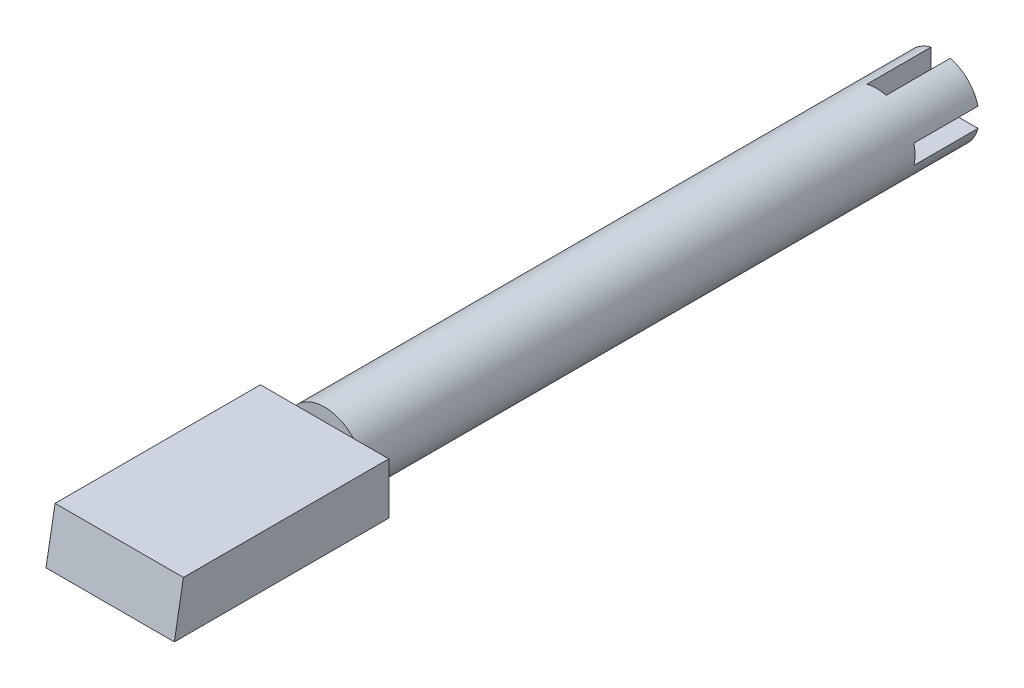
from build123d import *

# Parameters (mm, degrees)
SKETCH_1_R          = 3
EXTRUDE_1_DEPTH     = 48
EXTRUDE_2_DEPTH     = 5
SKETCH_3_W          = 1.5
SKETCH_3_H          = 2.15473751
SKETCH_3_W_2        = 2.15473751
SKETCH_3_H_2        = 1.5
CUT_EXTRUDE_2_DEPTH = 5


with BuildPart() as part:
    # Sketch 1 → Extrude 1 (new body)
    with BuildSketch(Plane.XY):
        Circle(SKETCH_1_R)
    extrude(amount=EXTRUDE_1_DEPTH)

    # Sketch 2 → Extrude 2 (add, symmetric)
    with BuildSketch(Plane(origin=(0, 0, 0), x_dir=(0, 0, -1), z_dir=(1, 0, 0))):
        Polygon((-48, 2), (-64, 2), (-64.705307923, -2), (-48, -2), align=None)
    extrude(amount=EXTRUDE_2_DEPTH, both=True)

    # Sketch 3 → Cut-Extrude 2 (cut)
    with BuildSketch(Plane(origin=(0, 0, 0), x_dir=(-1, 0, 0), z_dir=(0, 0, -1))):
        with Locations((0, 1.827368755)):
            Rectangle(SKETCH_3_W, SKETCH_3_H)
        with BuildLine():
            Line((-0.75, 2.90473751), (0.75, 2.90473751))
            ThreePointArc((0.75, 2.90473751), (0, 3), (-0.75, 2.90473751))
        make_face()
        with BuildLine():
            ThreePointArc((-0.75, -2.90473751), (0, -3), (0.75, -2.90473751))
            Line((0.75, -2.90473751), (-0.75, -2.90473751))
        make_face()
        with Locations((0, -1.827368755)):
            Rectangle(SKETCH_3_W, SKETCH_3_H)
        with Locations((-1.827368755, 0)):
            Rectangle(SKETCH_3_W_2, SKETCH_3_H_2)
        with Locations((1.827368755, 0)):
            Rectangle(SKETCH_3_W_2, SKETCH_3_H_2)
        with BuildLine():
            ThreePointArc((3, 0), (2.976089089, 0.378012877), (2.90473751, 0.75))
            Line((2.90473751, 0.75), (2.90473751, -0.75))
            ThreePointArc((2.90473751, -0.75), (2.976089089, -0.378012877), (3, 0))
        make_face()
        with BuildLine():
            Line((-2.90473751, -0.75), (-2.90473751, 0.75))
            ThreePointArc((-2.90473751, 0.75), (-3, 0), (-2.90473751, -0.75))
        make_face()
        Rectangle(SKETCH_3_W, SKETCH_3_H_2)
    extrude(amount=-CUT_EXTRUDE_2_DEPTH, mode=Mode.SUBTRACT)


solid = part.part
